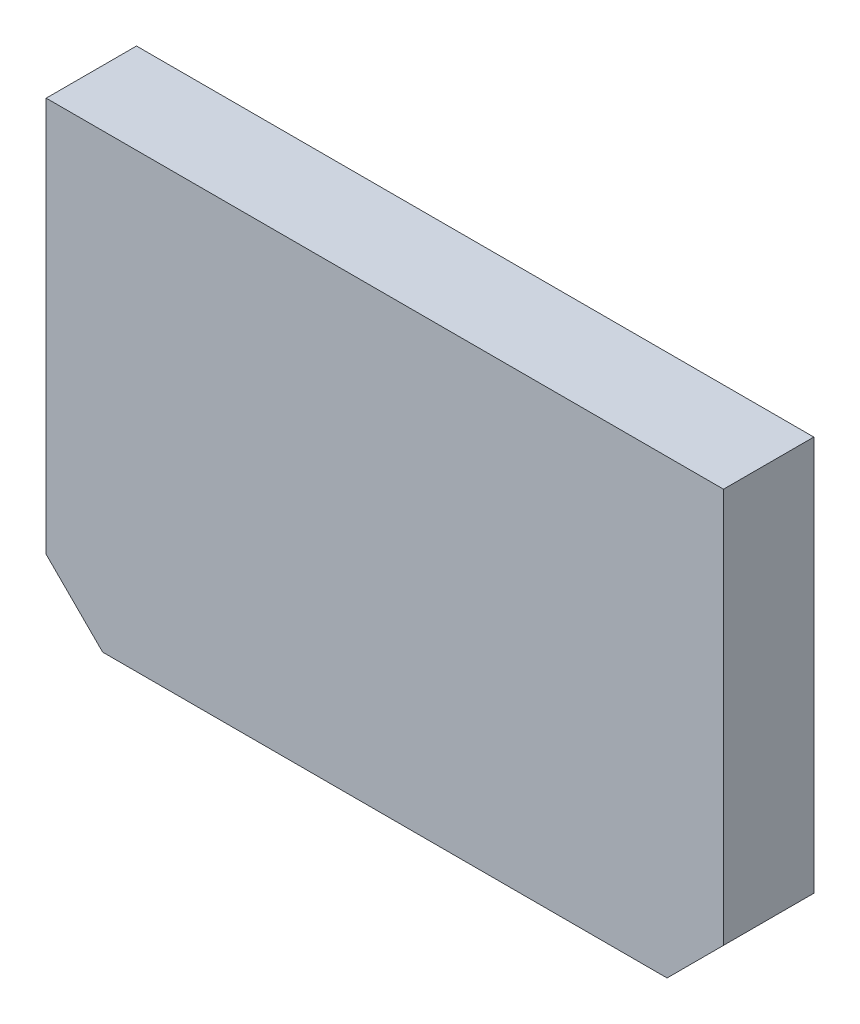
from build123d import *

# Parameters (mm, degrees)
SKETCH_1_W      = 60
SKETCH_1_H      = 40
EXTRUDE_1_DEPTH = 8
CHAMFER_1_SIZE  = 5


with BuildPart() as part:
    # Sketch 1 → Extrude 1 (new body)
    with BuildSketch(Plane.XY):
        with Locations((30, 20)):
            Rectangle(SKETCH_1_W, SKETCH_1_H)
    extrude(amount=EXTRUDE_1_DEPTH)

    # Chamfer 1
    chamfer_1_edges = [part.edges().sort_by_distance(p)[0] for p in [
        (60, 0, 4),
        (0, 0, 4),
    ]]
    chamfer(chamfer_1_edges, length=CHAMFER_1_SIZE)


solid = part.part
